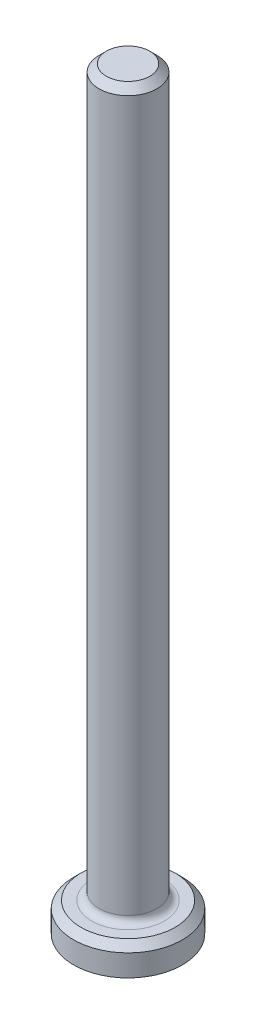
from build123d import *

# Parameters (mm, degrees)
SKETCH1_R           = 101.6
BOSS_EXTRUDE1_DEPTH = 1270
SKETCH2_R           = 190.5
BOSS_EXTRUDE2_DEPTH = 101.6
CHAMFER1_SIZE       = 25.4
CHAMFER2_SIZE       = 25.4
FILLET1_R           = 25.4


with BuildPart() as part:
    # Sketch1 → Boss-Extrude1 (new, symmetric)
    with BuildSketch(Plane(origin=(0, 0, 0), x_dir=(1, 0, 0), z_dir=(0, 1, 0))):
        with Locations(Location((0, 0, 0), (0, 0, 90))):
            Circle(SKETCH1_R)
    extrude(amount=BOSS_EXTRUDE1_DEPTH, both=True)

    # Sketch2 → Boss-Extrude2 (add)
    with BuildSketch(Plane.XZ.offset(1270)):
        with Locations(Location((0, 0, 0), (0, 0, 270))):
            Circle(SKETCH2_R)
    extrude(amount=BOSS_EXTRUDE2_DEPTH)

    # Chamfer1
    chamfer1_edges = [part.edges().sort_by_distance(p)[0] for p in [
        (0, -1270, 190.5),
    ]]
    chamfer(chamfer1_edges, length=CHAMFER1_SIZE)

    # Chamfer2
    chamfer2_edges = [part.edges().sort_by_distance(p)[0] for p in [
        (0, 1270, 101.6),
    ]]
    chamfer(chamfer2_edges, length=CHAMFER2_SIZE)

    # Fillet1
    fillet1_edges = [part.edges().sort_by_distance(p)[0] for p in [
        (0, -1270, 101.6),
    ]]
    fillet(fillet1_edges, radius=FILLET1_R)


solid = part.part
